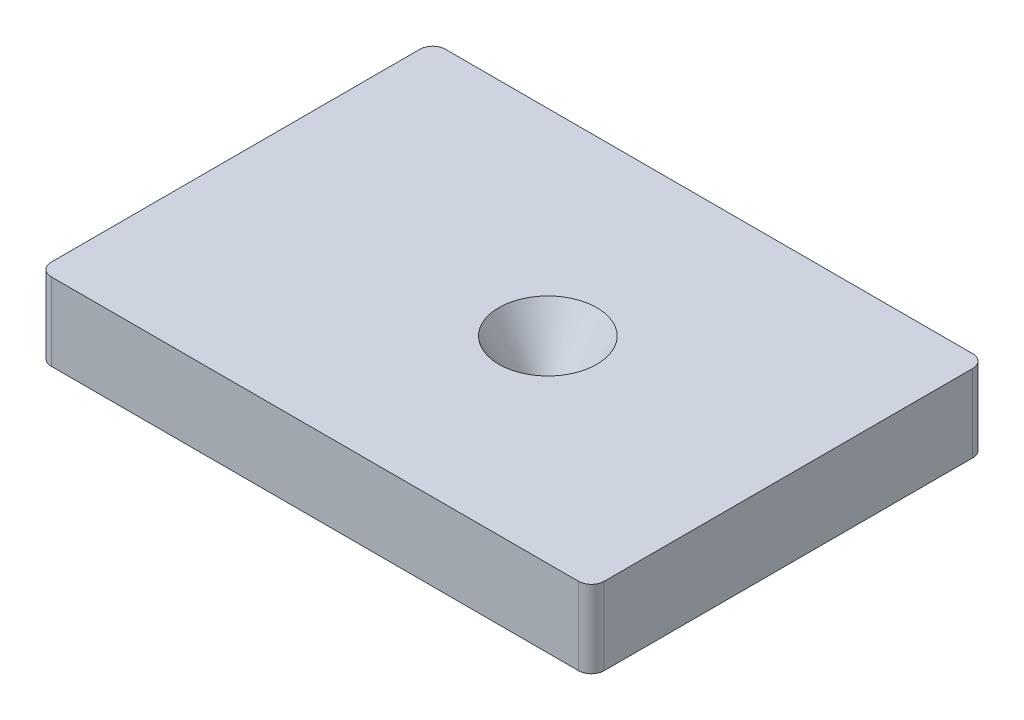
ISO-10303-21;
HEADER;
FILE_DESCRIPTION(('STEP AP214'),'2;1');
FILE_NAME('part.step','',(''),(''),'','','');
FILE_SCHEMA(('AUTOMOTIVE_DESIGN { 1 0 10303 214 1 1 1 1 }'));
ENDSEC;
DATA;
#1=APPLICATION_CONTEXT('core data for automotive mechanical design processes');
#2=APPLICATION_PROTOCOL_DEFINITION('international standard','automotive_design',2000,#1);
#3=PRODUCT_CONTEXT('',#1,'mechanical');
#4=PRODUCT('Part','Part','',(#3));
#5=PRODUCT_RELATED_PRODUCT_CATEGORY('part','',(#4));
#6=PRODUCT_DEFINITION_FORMATION('','',#4);
#7=PRODUCT_DEFINITION_CONTEXT('part definition',#1,'design');
#8=PRODUCT_DEFINITION('design','',#6,#7);
#9=PRODUCT_DEFINITION_SHAPE('','',#8);
#10=(LENGTH_UNIT() NAMED_UNIT(*) SI_UNIT(.MILLI.,.METRE.));
#11=(NAMED_UNIT(*) PLANE_ANGLE_UNIT() SI_UNIT($,.RADIAN.));
#12=(NAMED_UNIT(*) SI_UNIT($,.STERADIAN.) SOLID_ANGLE_UNIT());
#13=UNCERTAINTY_MEASURE_WITH_UNIT(LENGTH_MEASURE(1.E-05),#10,'distance_accuracy_value','');
#14=(GEOMETRIC_REPRESENTATION_CONTEXT(3) GLOBAL_UNCERTAINTY_ASSIGNED_CONTEXT((#13)) GLOBAL_UNIT_ASSIGNED_CONTEXT((#10,
#11,#12)) REPRESENTATION_CONTEXT('',''));
#15=CARTESIAN_POINT('',(0.,0.,0.));
#16=DIRECTION('',(0.,0.,1.));
#17=DIRECTION('',(1.,0.,0.));
#18=AXIS2_PLACEMENT_3D('',#15,#16,#17);
#19=CARTESIAN_POINT('',(0.,0.,977.9));
#20=DIRECTION('',(0.,1.,0.));
#21=DIRECTION('',(0.,0.,1.));
#22=AXIS2_PLACEMENT_3D('',#19,#20,#21);
#23=PLANE('',#22);
#24=DIRECTION('',(-1.,0.,0.));
#25=VECTOR('',#24,1.);
#26=CARTESIAN_POINT('',(-3.59262766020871E-13,0.,-977.9));
#27=LINE('',#26,#25);
#28=CARTESIAN_POINT('',(-63.5000000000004,0.,-977.9));
#29=VERTEX_POINT('',#28);
#30=CARTESIAN_POINT('',(-2679.7,0.,-977.899999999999));
#31=VERTEX_POINT('',#30);
#32=EDGE_CURVE('E144',#29,#31,#27,.T.);
#33=ORIENTED_EDGE('',*,*,#32,.T.);
#34=CARTESIAN_POINT('',(-2679.7,0.,-914.399999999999));
#35=DIRECTION('',(0.,1.,0.));
#36=DIRECTION('',(0.,0.,1.));
#37=AXIS2_PLACEMENT_3D('',#34,#35,#36);
#38=CIRCLE('',#37,63.5);
#39=CARTESIAN_POINT('',(-2743.2,0.,-914.399999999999));
#40=VERTEX_POINT('',#39);
#41=EDGE_CURVE('E175',#31,#40,#38,.T.);
#42=ORIENTED_EDGE('',*,*,#41,.T.);
#43=DIRECTION('',(0.,0.,1.));
#44=VECTOR('',#43,1.);
#45=CARTESIAN_POINT('',(-2743.2,0.,977.9));
#46=LINE('',#45,#44);
#47=CARTESIAN_POINT('',(-2743.2,0.,914.4));
#48=VERTEX_POINT('',#47);
#49=EDGE_CURVE('E147',#40,#48,#46,.T.);
#50=ORIENTED_EDGE('',*,*,#49,.T.);
#51=CARTESIAN_POINT('',(-2679.7,0.,914.4));
#52=DIRECTION('',(0.,1.,0.));
#53=DIRECTION('',(0.,0.,1.));
#54=AXIS2_PLACEMENT_3D('',#51,#52,#53);
#55=CIRCLE('',#54,63.5);
#56=CARTESIAN_POINT('',(-2679.7,0.,977.9));
#57=VERTEX_POINT('',#56);
#58=EDGE_CURVE('E173',#48,#57,#55,.T.);
#59=ORIENTED_EDGE('',*,*,#58,.T.);
#60=DIRECTION('',(1.,0.,0.));
#61=VECTOR('',#60,1.);
#62=CARTESIAN_POINT('',(0.,0.,977.9));
#63=LINE('',#62,#61);
#64=CARTESIAN_POINT('',(-63.5,0.,977.9));
#65=VERTEX_POINT('',#64);
#66=EDGE_CURVE('E150',#57,#65,#63,.T.);
#67=ORIENTED_EDGE('',*,*,#66,.T.);
#68=CARTESIAN_POINT('',(-63.5,0.,914.4));
#69=DIRECTION('',(0.,1.,0.));
#70=DIRECTION('',(0.,0.,1.));
#71=AXIS2_PLACEMENT_3D('',#68,#69,#70);
#72=CIRCLE('',#71,63.5);
#73=CARTESIAN_POINT('',(0.,0.,914.4));
#74=VERTEX_POINT('',#73);
#75=EDGE_CURVE('E171',#65,#74,#72,.T.);
#76=ORIENTED_EDGE('',*,*,#75,.T.);
#77=DIRECTION('',(0.,0.,-1.));
#78=VECTOR('',#77,1.);
#79=CARTESIAN_POINT('',(0.,0.,977.9));
#80=LINE('',#79,#78);
#81=CARTESIAN_POINT('',(-3.47598390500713E-13,0.,-914.4));
#82=VERTEX_POINT('',#81);
#83=EDGE_CURVE('E137',#74,#82,#80,.T.);
#84=ORIENTED_EDGE('',*,*,#83,.T.);
#85=CARTESIAN_POINT('',(-63.5000000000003,0.,-914.4));
#86=DIRECTION('',(0.,1.,0.));
#87=DIRECTION('',(0.,0.,1.));
#88=AXIS2_PLACEMENT_3D('',#85,#86,#87);
#89=CIRCLE('',#88,63.5);
#90=EDGE_CURVE('E169',#82,#29,#89,.T.);
#91=ORIENTED_EDGE('',*,*,#90,.T.);
#92=EDGE_LOOP('',(#33,#42,#50,#59,#67,#76,#84,#91));
#93=FACE_BOUND('',#92,.T.);
#94=CARTESIAN_POINT('',(-1193.8,0.,0.));
#95=DIRECTION('',(0.,1.,0.));
#96=DIRECTION('',(0.,0.,1.));
#97=AXIS2_PLACEMENT_3D('',#94,#95,#96);
#98=CIRCLE('',#97,243.377543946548);
#99=CARTESIAN_POINT('',(-1193.8,0.,243.377543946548));
#100=VERTEX_POINT('',#99);
#101=EDGE_CURVE('E128',#100,#100,#98,.T.);
#102=ORIENTED_EDGE('',*,*,#101,.F.);
#103=EDGE_LOOP('',(#102));
#104=FACE_BOUND('',#103,.T.);
#105=ADVANCED_FACE('F28',(#93,#104),#23,.T.);
#106=CARTESIAN_POINT('',(0.,-384.302,977.9));
#107=DIRECTION('',(1.,0.,0.));
#108=DIRECTION('',(0.,0.,-1.));
#109=AXIS2_PLACEMENT_3D('',#106,#107,#108);
#110=PLANE('',#109);
#111=ORIENTED_EDGE('',*,*,#83,.F.);
#112=DIRECTION('',(0.,1.,0.));
#113=VECTOR('',#112,1.);
#114=CARTESIAN_POINT('',(0.,-384.302,914.4));
#115=LINE('',#114,#113);
#116=CARTESIAN_POINT('',(0.,-384.302,914.4));
#117=VERTEX_POINT('',#116);
#118=EDGE_CURVE('E11',#74,#117,#115,.F.);
#119=ORIENTED_EDGE('',*,*,#118,.T.);
#120=DIRECTION('',(0.,0.,-1.));
#121=VECTOR('',#120,1.);
#122=CARTESIAN_POINT('',(0.,-384.302,977.9));
#123=LINE('',#122,#121);
#124=CARTESIAN_POINT('',(-3.47598390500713E-13,-384.302,-914.4));
#125=VERTEX_POINT('',#124);
#126=EDGE_CURVE('E153',#117,#125,#123,.T.);
#127=ORIENTED_EDGE('',*,*,#126,.T.);
#128=DIRECTION('',(0.,1.,0.));
#129=VECTOR('',#128,1.);
#130=CARTESIAN_POINT('',(-3.47598390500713E-13,-384.302,-914.4));
#131=LINE('',#130,#129);
#132=EDGE_CURVE('E36',#125,#82,#131,.T.);
#133=ORIENTED_EDGE('',*,*,#132,.T.);
#134=EDGE_LOOP('',(#111,#119,#127,#133));
#135=FACE_BOUND('',#134,.T.);
#136=ADVANCED_FACE('F30',(#135),#110,.T.);
#137=CARTESIAN_POINT('',(0.,-384.302,977.9));
#138=DIRECTION('',(0.,0.,1.));
#139=DIRECTION('',(1.,0.,0.));
#140=AXIS2_PLACEMENT_3D('',#137,#138,#139);
#141=PLANE('',#140);
#142=ORIENTED_EDGE('',*,*,#66,.F.);
#143=DIRECTION('',(0.,1.,0.));
#144=VECTOR('',#143,1.);
#145=CARTESIAN_POINT('',(-2679.7,-384.302,977.9));
#146=LINE('',#145,#144);
#147=CARTESIAN_POINT('',(-2679.7,-384.302,977.9));
#148=VERTEX_POINT('',#147);
#149=EDGE_CURVE('E50',#57,#148,#146,.F.);
#150=ORIENTED_EDGE('',*,*,#149,.T.);
#151=DIRECTION('',(1.,0.,0.));
#152=VECTOR('',#151,1.);
#153=CARTESIAN_POINT('',(0.,-384.302,977.9));
#154=LINE('',#153,#152);
#155=CARTESIAN_POINT('',(-63.5,-384.302,977.9));
#156=VERTEX_POINT('',#155);
#157=EDGE_CURVE('E162',#148,#156,#154,.T.);
#158=ORIENTED_EDGE('',*,*,#157,.T.);
#159=DIRECTION('',(0.,1.,0.));
#160=VECTOR('',#159,1.);
#161=CARTESIAN_POINT('',(-63.5,-384.302,977.9));
#162=LINE('',#161,#160);
#163=EDGE_CURVE('E189',#156,#65,#162,.T.);
#164=ORIENTED_EDGE('',*,*,#163,.T.);
#165=EDGE_LOOP('',(#142,#150,#158,#164));
#166=FACE_BOUND('',#165,.T.);
#167=ADVANCED_FACE('F205',(#166),#141,.T.);
#168=CARTESIAN_POINT('',(-2743.2,-384.302,977.9));
#169=DIRECTION('',(-1.,0.,0.));
#170=DIRECTION('',(0.,0.,1.));
#171=AXIS2_PLACEMENT_3D('',#168,#169,#170);
#172=PLANE('',#171);
#173=ORIENTED_EDGE('',*,*,#49,.F.);
#174=DIRECTION('',(0.,1.,0.));
#175=VECTOR('',#174,1.);
#176=CARTESIAN_POINT('',(-2743.2,-384.302,-914.399999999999));
#177=LINE('',#176,#175);
#178=CARTESIAN_POINT('',(-2743.2,-384.302,-914.399999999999));
#179=VERTEX_POINT('',#178);
#180=EDGE_CURVE('E180',#40,#179,#177,.F.);
#181=ORIENTED_EDGE('',*,*,#180,.T.);
#182=DIRECTION('',(0.,0.,1.));
#183=VECTOR('',#182,1.);
#184=CARTESIAN_POINT('',(-2743.2,-384.302,977.9));
#185=LINE('',#184,#183);
#186=CARTESIAN_POINT('',(-2743.2,-384.302,914.4));
#187=VERTEX_POINT('',#186);
#188=EDGE_CURVE('E159',#179,#187,#185,.T.);
#189=ORIENTED_EDGE('',*,*,#188,.T.);
#190=DIRECTION('',(0.,1.,0.));
#191=VECTOR('',#190,1.);
#192=CARTESIAN_POINT('',(-2743.2,-384.302,914.4));
#193=LINE('',#192,#191);
#194=EDGE_CURVE('E177',#187,#48,#193,.T.);
#195=ORIENTED_EDGE('',*,*,#194,.T.);
#196=EDGE_LOOP('',(#173,#181,#189,#195));
#197=FACE_BOUND('',#196,.T.);
#198=ADVANCED_FACE('F212',(#197),#172,.T.);
#199=CARTESIAN_POINT('',(-3.59262766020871E-13,-384.302,-977.9));
#200=DIRECTION('',(0.,0.,-1.));
#201=DIRECTION('',(-1.,0.,0.));
#202=AXIS2_PLACEMENT_3D('',#199,#200,#201);
#203=PLANE('',#202);
#204=DIRECTION('',(-1.,0.,0.));
#205=VECTOR('',#204,1.);
#206=CARTESIAN_POINT('',(-3.59262766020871E-13,-384.302,-977.9));
#207=LINE('',#206,#205);
#208=CARTESIAN_POINT('',(-1879.6,-384.302,-977.9));
#209=VERTEX_POINT('',#208);
#210=CARTESIAN_POINT('',(-2679.7,-384.302,-977.899999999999));
#211=VERTEX_POINT('',#210);
#212=EDGE_CURVE('E156',#209,#211,#207,.T.);
#213=ORIENTED_EDGE('',*,*,#212,.T.);
#214=DIRECTION('',(0.,1.,0.));
#215=VECTOR('',#214,1.);
#216=CARTESIAN_POINT('',(-2679.7,-384.302,-977.899999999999));
#217=LINE('',#216,#215);
#218=EDGE_CURVE('E166',#211,#31,#217,.T.);
#219=ORIENTED_EDGE('',*,*,#218,.T.);
#220=ORIENTED_EDGE('',*,*,#32,.F.);
#221=DIRECTION('',(0.,1.,0.));
#222=VECTOR('',#221,1.);
#223=CARTESIAN_POINT('',(-63.5000000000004,-384.302,-977.9));
#224=LINE('',#223,#222);
#225=CARTESIAN_POINT('',(-63.5000000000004,-384.302,-977.9));
#226=VERTEX_POINT('',#225);
#227=EDGE_CURVE('E164',#29,#226,#224,.F.);
#228=ORIENTED_EDGE('',*,*,#227,.T.);
#229=CARTESIAN_POINT('',(-762.,-384.302,-977.9));
#230=VERTEX_POINT('',#229);
#231=EDGE_CURVE('E157',#226,#230,#207,.T.);
#232=ORIENTED_EDGE('',*,*,#231,.T.);
#233=DIRECTION('',(0.,1.,0.));
#234=VECTOR('',#233,1.);
#235=CARTESIAN_POINT('',(-762.,-384.302,-977.9));
#236=LINE('',#235,#234);
#237=CARTESIAN_POINT('',(-762.,-294.59096247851,-977.9));
#238=VERTEX_POINT('',#237);
#239=EDGE_CURVE('E118',#230,#238,#236,.T.);
#240=ORIENTED_EDGE('',*,*,#239,.T.);
#241=DIRECTION('',(1.,0.,0.));
#242=VECTOR('',#241,1.);
#243=CARTESIAN_POINT('',(-1879.6,-294.59096247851,-977.9));
#244=LINE('',#243,#242);
#245=CARTESIAN_POINT('',(-1879.6,-294.59096247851,-977.9));
#246=VERTEX_POINT('',#245);
#247=EDGE_CURVE('E127',#246,#238,#244,.T.);
#248=ORIENTED_EDGE('',*,*,#247,.F.);
#249=DIRECTION('',(0.,1.,0.));
#250=VECTOR('',#249,1.);
#251=CARTESIAN_POINT('',(-1879.6,-384.302,-977.9));
#252=LINE('',#251,#250);
#253=EDGE_CURVE('E135',#209,#246,#252,.T.);
#254=ORIENTED_EDGE('',*,*,#253,.F.);
#255=EDGE_LOOP('',(#213,#219,#220,#228,#232,#240,#248,#254));
#256=FACE_BOUND('',#255,.T.);
#257=ADVANCED_FACE('F220',(#256),#203,.T.);
#258=CARTESIAN_POINT('',(0.,-384.302,977.9));
#259=DIRECTION('',(0.,1.,0.));
#260=DIRECTION('',(0.,0.,1.));
#261=AXIS2_PLACEMENT_3D('',#258,#259,#260);
#262=PLANE('',#261);
#263=ORIENTED_EDGE('',*,*,#188,.F.);
#264=CARTESIAN_POINT('',(-2679.7,-384.302,-914.399999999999));
#265=DIRECTION('',(0.,1.,0.));
#266=DIRECTION('',(0.,0.,1.));
#267=AXIS2_PLACEMENT_3D('',#264,#265,#266);
#268=CIRCLE('',#267,63.5);
#269=EDGE_CURVE('E187',#179,#211,#268,.F.);
#270=ORIENTED_EDGE('',*,*,#269,.T.);
#271=ORIENTED_EDGE('',*,*,#212,.F.);
#272=DIRECTION('',(0.,0.,-1.));
#273=VECTOR('',#272,1.);
#274=CARTESIAN_POINT('',(-1879.6,-384.302,-825.234528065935));
#275=LINE('',#274,#273);
#276=CARTESIAN_POINT('',(-1879.6,-384.302,-825.234528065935));
#277=VERTEX_POINT('',#276);
#278=EDGE_CURVE('E134',#277,#209,#275,.T.);
#279=ORIENTED_EDGE('',*,*,#278,.F.);
#280=DIRECTION('',(1.,0.,0.));
#281=VECTOR('',#280,1.);
#282=CARTESIAN_POINT('',(-1879.6,-384.302,-825.234528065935));
#283=LINE('',#282,#281);
#284=CARTESIAN_POINT('',(-762.,-384.302,-825.234528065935));
#285=VERTEX_POINT('',#284);
#286=EDGE_CURVE('E124',#277,#285,#283,.T.);
#287=ORIENTED_EDGE('',*,*,#286,.T.);
#288=DIRECTION('',(0.,0.,-1.));
#289=VECTOR('',#288,1.);
#290=CARTESIAN_POINT('',(-762.,-384.302,-825.234528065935));
#291=LINE('',#290,#289);
#292=EDGE_CURVE('E113',#285,#230,#291,.T.);
#293=ORIENTED_EDGE('',*,*,#292,.T.);
#294=ORIENTED_EDGE('',*,*,#231,.F.);
#295=CARTESIAN_POINT('',(-63.5000000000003,-384.302,-914.4));
#296=DIRECTION('',(0.,1.,0.));
#297=DIRECTION('',(0.,0.,1.));
#298=AXIS2_PLACEMENT_3D('',#295,#296,#297);
#299=CIRCLE('',#298,63.5);
#300=EDGE_CURVE('E182',#226,#125,#299,.F.);
#301=ORIENTED_EDGE('',*,*,#300,.T.);
#302=ORIENTED_EDGE('',*,*,#126,.F.);
#303=CARTESIAN_POINT('',(-63.5,-384.302,914.4));
#304=DIRECTION('',(0.,1.,0.));
#305=DIRECTION('',(0.,0.,1.));
#306=AXIS2_PLACEMENT_3D('',#303,#304,#305);
#307=CIRCLE('',#306,63.5);
#308=EDGE_CURVE('E43',#117,#156,#307,.F.);
#309=ORIENTED_EDGE('',*,*,#308,.T.);
#310=ORIENTED_EDGE('',*,*,#157,.F.);
#311=CARTESIAN_POINT('',(-2679.7,-384.302,914.4));
#312=DIRECTION('',(0.,1.,0.));
#313=DIRECTION('',(0.,0.,1.));
#314=AXIS2_PLACEMENT_3D('',#311,#312,#313);
#315=CIRCLE('',#314,63.5);
#316=EDGE_CURVE('E185',#148,#187,#315,.F.);
#317=ORIENTED_EDGE('',*,*,#316,.T.);
#318=EDGE_LOOP('',(#263,#270,#271,#279,#287,#293,#294,#301,#302,#309,#310,#317));
#319=FACE_BOUND('',#318,.T.);
#320=ADVANCED_FACE('F132',(#319),#262,.F.);
#321=CARTESIAN_POINT('',(-1879.6,-294.59096247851,-977.9));
#322=DIRECTION('',(0.,0.862161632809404,0.506633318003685));
#323=DIRECTION('',(0.,-0.506633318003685,0.862161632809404));
#324=AXIS2_PLACEMENT_3D('',#321,#322,#323);
#325=PLANE('',#324);
#326=DIRECTION('',(0.,-0.506633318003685,0.862161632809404));
#327=VECTOR('',#326,1.);
#328=CARTESIAN_POINT('',(-762.,-294.59096247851,-977.9));
#329=LINE('',#328,#327);
#330=EDGE_CURVE('E116',#238,#285,#329,.T.);
#331=ORIENTED_EDGE('',*,*,#330,.T.);
#332=ORIENTED_EDGE('',*,*,#286,.F.);
#333=DIRECTION('',(0.,-0.506633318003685,0.862161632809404));
#334=VECTOR('',#333,1.);
#335=CARTESIAN_POINT('',(-1879.6,-294.59096247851,-977.9));
#336=LINE('',#335,#334);
#337=EDGE_CURVE('E225',#246,#277,#336,.T.);
#338=ORIENTED_EDGE('',*,*,#337,.F.);
#339=ORIENTED_EDGE('',*,*,#247,.T.);
#340=EDGE_LOOP('',(#331,#332,#338,#339));
#341=FACE_BOUND('',#340,.T.);
#342=ADVANCED_FACE('F123',(#341),#325,.F.);
#343=CARTESIAN_POINT('',(-1879.6,-294.59096247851,-977.9));
#344=DIRECTION('',(-1.,0.,0.));
#345=DIRECTION('',(0.,0.,1.));
#346=AXIS2_PLACEMENT_3D('',#343,#344,#345);
#347=PLANE('',#346);
#348=ORIENTED_EDGE('',*,*,#337,.T.);
#349=ORIENTED_EDGE('',*,*,#278,.T.);
#350=ORIENTED_EDGE('',*,*,#253,.T.);
#351=EDGE_LOOP('',(#348,#349,#350));
#352=FACE_BOUND('',#351,.T.);
#353=ADVANCED_FACE('F224',(#352),#347,.F.);
#354=CARTESIAN_POINT('',(-762.,-294.59096247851,-977.9));
#355=DIRECTION('',(-1.,0.,0.));
#356=DIRECTION('',(0.,0.,1.));
#357=AXIS2_PLACEMENT_3D('',#354,#355,#356);
#358=PLANE('',#357);
#359=ORIENTED_EDGE('',*,*,#330,.F.);
#360=ORIENTED_EDGE('',*,*,#239,.F.);
#361=ORIENTED_EDGE('',*,*,#292,.F.);
#362=EDGE_LOOP('',(#359,#360,#361));
#363=FACE_BOUND('',#362,.T.);
#364=ADVANCED_FACE('F115',(#363),#358,.T.);
#365=CARTESIAN_POINT('',(-2679.7,-384.302,-914.399999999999));
#366=DIRECTION('',(0.,1.,0.));
#367=DIRECTION('',(0.,0.,1.));
#368=AXIS2_PLACEMENT_3D('',#365,#366,#367);
#369=CYLINDRICAL_SURFACE('',#368,63.5);
#370=ORIENTED_EDGE('',*,*,#269,.F.);
#371=ORIENTED_EDGE('',*,*,#180,.F.);
#372=ORIENTED_EDGE('',*,*,#41,.F.);
#373=ORIENTED_EDGE('',*,*,#218,.F.);
#374=EDGE_LOOP('',(#370,#371,#372,#373));
#375=FACE_BOUND('',#374,.T.);
#376=ADVANCED_FACE('F217',(#375),#369,.T.);
#377=CARTESIAN_POINT('',(-2679.7,-384.302,914.4));
#378=DIRECTION('',(0.,1.,0.));
#379=DIRECTION('',(0.,0.,1.));
#380=AXIS2_PLACEMENT_3D('',#377,#378,#379);
#381=CYLINDRICAL_SURFACE('',#380,63.5);
#382=ORIENTED_EDGE('',*,*,#316,.F.);
#383=ORIENTED_EDGE('',*,*,#149,.F.);
#384=ORIENTED_EDGE('',*,*,#58,.F.);
#385=ORIENTED_EDGE('',*,*,#194,.F.);
#386=EDGE_LOOP('',(#382,#383,#384,#385));
#387=FACE_BOUND('',#386,.T.);
#388=ADVANCED_FACE('F209',(#387),#381,.T.);
#389=CARTESIAN_POINT('',(-63.5,-384.302,914.4));
#390=DIRECTION('',(0.,1.,0.));
#391=DIRECTION('',(0.,0.,1.));
#392=AXIS2_PLACEMENT_3D('',#389,#390,#391);
#393=CYLINDRICAL_SURFACE('',#392,63.5);
#394=ORIENTED_EDGE('',*,*,#308,.F.);
#395=ORIENTED_EDGE('',*,*,#118,.F.);
#396=ORIENTED_EDGE('',*,*,#75,.F.);
#397=ORIENTED_EDGE('',*,*,#163,.F.);
#398=EDGE_LOOP('',(#394,#395,#396,#397));
#399=FACE_BOUND('',#398,.T.);
#400=ADVANCED_FACE('F204',(#399),#393,.T.);
#401=CARTESIAN_POINT('',(-63.5000000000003,-384.302,-914.4));
#402=DIRECTION('',(0.,1.,0.));
#403=DIRECTION('',(0.,0.,1.));
#404=AXIS2_PLACEMENT_3D('',#401,#402,#403);
#405=CYLINDRICAL_SURFACE('',#404,63.5);
#406=ORIENTED_EDGE('',*,*,#300,.F.);
#407=ORIENTED_EDGE('',*,*,#227,.F.);
#408=ORIENTED_EDGE('',*,*,#90,.F.);
#409=ORIENTED_EDGE('',*,*,#132,.F.);
#410=EDGE_LOOP('',(#406,#407,#408,#409));
#411=FACE_BOUND('',#410,.T.);
#412=ADVANCED_FACE('F241',(#411),#405,.T.);
#413=CARTESIAN_POINT('',(-1193.8,-289.56,0.));
#414=DIRECTION('',(0.,1.,0.));
#415=DIRECTION('',(0.,0.,1.));
#416=AXIS2_PLACEMENT_3D('',#413,#414,#415);
#417=CONICAL_SURFACE('',#416,76.2,0.5235987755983);
#418=CARTESIAN_POINT('',(-1193.8,-289.56,0.));
#419=DIRECTION('',(0.,1.,0.));
#420=DIRECTION('',(0.,0.,1.));
#421=AXIS2_PLACEMENT_3D('',#418,#419,#420);
#422=CIRCLE('',#421,76.2);
#423=CARTESIAN_POINT('',(-1193.8,-289.56,76.1999999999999));
#424=VERTEX_POINT('',#423);
#425=EDGE_CURVE('E232',#424,#424,#422,.T.);
#426=CARTESIAN_POINT('',(-1193.8,-289.56,76.1999999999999));
#427=CARTESIAN_POINT('',(-1193.8,-286.54375,77.9414327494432));
#428=CARTESIAN_POINT('',(-1193.8,-283.5275,79.6828654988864));
#429=CARTESIAN_POINT('',(-1193.8,-277.495,83.1657309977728));
#430=CARTESIAN_POINT('',(-1193.8,-274.47875,84.907163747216));
#431=CARTESIAN_POINT('',(-1193.8,-268.44625,88.3900292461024));
#432=CARTESIAN_POINT('',(-1193.8,-265.43,90.1314619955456));
#433=CARTESIAN_POINT('',(-1193.8,-259.3975,93.6143274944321));
#434=CARTESIAN_POINT('',(-1193.8,-256.38125,95.3557602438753));
#435=CARTESIAN_POINT('',(-1193.8,-250.34875,98.8386257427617));
#436=CARTESIAN_POINT('',(-1193.8,-247.3325,100.580058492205));
#437=CARTESIAN_POINT('',(-1193.8,-241.3,104.062923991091));
#438=CARTESIAN_POINT('',(-1193.8,-238.28375,105.804356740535));
#439=CARTESIAN_POINT('',(-1193.8,-232.25125,109.287222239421));
#440=CARTESIAN_POINT('',(-1193.8,-229.235,111.028654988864));
#441=CARTESIAN_POINT('',(-1193.8,-223.2025,114.511520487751));
#442=CARTESIAN_POINT('',(-1193.8,-220.18625,116.252953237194));
#443=CARTESIAN_POINT('',(-1193.8,-214.15375,119.73581873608));
#444=CARTESIAN_POINT('',(-1193.8,-211.1375,121.477251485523));
#445=CARTESIAN_POINT('',(-1193.8,-205.105,124.96011698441));
#446=CARTESIAN_POINT('',(-1193.8,-202.08875,126.701549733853));
#447=CARTESIAN_POINT('',(-1193.8,-196.05625,130.18441523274));
#448=CARTESIAN_POINT('',(-1193.8,-193.04,131.925847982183));
#449=CARTESIAN_POINT('',(-1193.8,-187.0075,135.408713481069));
#450=CARTESIAN_POINT('',(-1193.8,-183.99125,137.150146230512));
#451=CARTESIAN_POINT('',(-1193.8,-177.95875,140.633011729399));
#452=CARTESIAN_POINT('',(-1193.8,-174.9425,142.374444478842));
#453=CARTESIAN_POINT('',(-1193.8,-168.91,145.857309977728));
#454=CARTESIAN_POINT('',(-1193.8,-165.89375,147.598742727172));
#455=CARTESIAN_POINT('',(-1193.8,-159.86125,151.081608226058));
#456=CARTESIAN_POINT('',(-1193.8,-156.845,152.823040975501));
#457=CARTESIAN_POINT('',(-1193.8,-150.8125,156.305906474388));
#458=CARTESIAN_POINT('',(-1193.8,-147.79625,158.047339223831));
#459=CARTESIAN_POINT('',(-1193.8,-141.76375,161.530204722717));
#460=CARTESIAN_POINT('',(-1193.8,-138.7475,163.271637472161));
#461=CARTESIAN_POINT('',(-1193.8,-132.715,166.754502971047));
#462=CARTESIAN_POINT('',(-1193.8,-129.69875,168.49593572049));
#463=CARTESIAN_POINT('',(-1193.8,-123.66625,171.978801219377));
#464=CARTESIAN_POINT('',(-1193.8,-120.65,173.72023396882));
#465=CARTESIAN_POINT('',(-1193.8,-114.6175,177.203099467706));
#466=CARTESIAN_POINT('',(-1193.8,-111.60125,178.94453221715));
#467=CARTESIAN_POINT('',(-1193.8,-105.56875,182.427397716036));
#468=CARTESIAN_POINT('',(-1193.8,-102.5525,184.168830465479));
#469=CARTESIAN_POINT('',(-1193.8,-96.5200000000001,187.651695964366));
#470=CARTESIAN_POINT('',(-1193.8,-93.5037500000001,189.393128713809));
#471=CARTESIAN_POINT('',(-1193.8,-87.4712500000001,192.875994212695));
#472=CARTESIAN_POINT('',(-1193.8,-84.4550000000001,194.617426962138));
#473=CARTESIAN_POINT('',(-1193.8,-78.4225000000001,198.100292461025));
#474=CARTESIAN_POINT('',(-1193.8,-75.4062500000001,199.841725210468));
#475=CARTESIAN_POINT('',(-1193.8,-69.3737500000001,203.324590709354));
#476=CARTESIAN_POINT('',(-1193.8,-66.3575000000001,205.066023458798));
#477=CARTESIAN_POINT('',(-1193.8,-60.3250000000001,208.548888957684));
#478=CARTESIAN_POINT('',(-1193.8,-57.3087500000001,210.290321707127));
#479=CARTESIAN_POINT('',(-1193.8,-51.2762500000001,213.773187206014));
#480=CARTESIAN_POINT('',(-1193.8,-48.2600000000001,215.514619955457));
#481=CARTESIAN_POINT('',(-1193.8,-42.2275000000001,218.997485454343));
#482=CARTESIAN_POINT('',(-1193.8,-39.21125,220.738918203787));
#483=CARTESIAN_POINT('',(-1193.8,-33.17875,224.221783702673));
#484=CARTESIAN_POINT('',(-1193.8,-30.1625,225.963216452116));
#485=CARTESIAN_POINT('',(-1193.8,-24.13,229.446081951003));
#486=CARTESIAN_POINT('',(-1193.8,-21.11375,231.187514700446));
#487=CARTESIAN_POINT('',(-1193.8,-15.08125,234.670380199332));
#488=CARTESIAN_POINT('',(-1193.8,-12.065,236.411812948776));
#489=CARTESIAN_POINT('',(-1193.8,-6.03250000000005,239.894678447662));
#490=CARTESIAN_POINT('',(-1193.8,-3.01625000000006,241.636111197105));
#491=CARTESIAN_POINT('',(-1193.8,0.,243.377543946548));
#492=B_SPLINE_CURVE_WITH_KNOTS('',3,(#426,#427,#428,#429,#430,#431,#432,#433,#434,#435,#436,
#437,#438,#439,#440,#441,#442,#443,#444,#445,#446,#447,#448,#449,#450,#451,#452,#453,#454,#455,
#456,#457,#458,#459,#460,#461,#462,#463,#464,#465,#466,#467,#468,#469,#470,#471,#472,#473,#474,
#475,#476,#477,#478,#479,#480,#481,#482,#483,#484,#485,#486,#487,#488,#489,#490,#491),
.UNSPECIFIED.,.F.,.F.,(4,2,2,2,2,2,2,2,2,2,2,2,2,2,2,2,2,2,2,2,2,2,2,2,2,2,2,2,2,2,2,2,4),(0.,
10.4485964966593,20.8971929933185,31.3457894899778,41.794385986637,52.2429824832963,
62.6915789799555,73.1401754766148,83.588771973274,94.0373684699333,104.485964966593,
114.934561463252,125.383157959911,135.83175445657,146.28035095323,156.728947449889,
167.177543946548,177.626140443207,188.074736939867,198.523333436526,208.971929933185,
219.420526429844,229.869122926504,240.317719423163,250.766315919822,261.214912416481,
271.663508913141,282.1121054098,292.560701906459,303.009298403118,313.457894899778,
323.906491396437,334.355087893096),.UNSPECIFIED.);
#493=EDGE_CURVE('BSEAM238',#424,#100,#492,.T.);
#494=ORIENTED_EDGE('',*,*,#425,.F.);
#495=ORIENTED_EDGE('',*,*,#101,.T.);
#496=ORIENTED_EDGE('',*,*,#493,.T.);
#497=ORIENTED_EDGE('',*,*,#493,.F.);
#498=EDGE_LOOP('',(#494,#496,#495,#497));
#499=FACE_BOUND('',#498,.T.);
#500=ADVANCED_FACE('F238',(#499),#417,.F.);
#501=CARTESIAN_POINT('',(-1193.8,-289.56,0.));
#502=DIRECTION('',(0.,1.,0.));
#503=DIRECTION('',(0.,0.,1.));
#504=AXIS2_PLACEMENT_3D('',#501,#502,#503);
#505=PLANE('',#504);
#506=ORIENTED_EDGE('',*,*,#425,.T.);
#507=EDGE_LOOP('',(#506));
#508=FACE_BOUND('',#507,.T.);
#509=ADVANCED_FACE('F236',(#508),#505,.T.);
#510=CLOSED_SHELL('',(#105,#136,#167,#198,#257,#320,#342,#353,#364,#376,#388,#400,#412,#500,#509));
#511=MANIFOLD_SOLID_BREP('B2',#510);
#512=ADVANCED_BREP_SHAPE_REPRESENTATION('',(#18,#511),#14);
#513=SHAPE_DEFINITION_REPRESENTATION(#9,#512);
ENDSEC;
END-ISO-10303-21;
